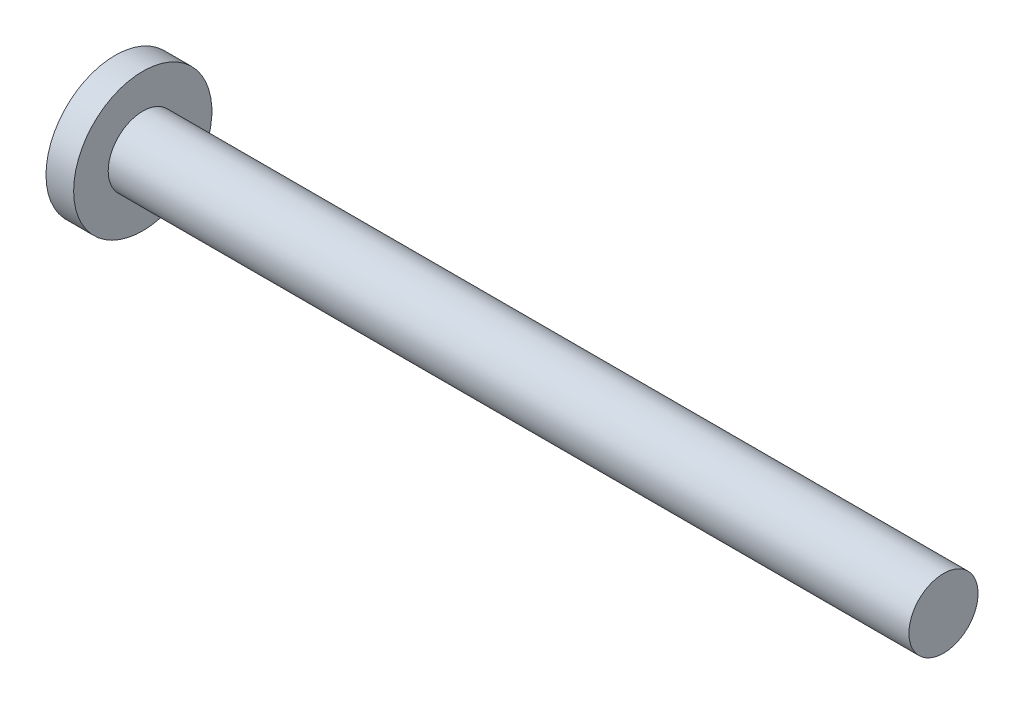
ISO-10303-21;
HEADER;
FILE_DESCRIPTION(('STEP AP214'),'2;1');
FILE_NAME('part.step','',(''),(''),'','','');
FILE_SCHEMA(('AUTOMOTIVE_DESIGN { 1 0 10303 214 1 1 1 1 }'));
ENDSEC;
DATA;
#1=APPLICATION_CONTEXT('core data for automotive mechanical design processes');
#2=APPLICATION_PROTOCOL_DEFINITION('international standard','automotive_design',2000,#1);
#3=PRODUCT_CONTEXT('',#1,'mechanical');
#4=PRODUCT('Part','Part','',(#3));
#5=PRODUCT_RELATED_PRODUCT_CATEGORY('part','',(#4));
#6=PRODUCT_DEFINITION_FORMATION('','',#4);
#7=PRODUCT_DEFINITION_CONTEXT('part definition',#1,'design');
#8=PRODUCT_DEFINITION('design','',#6,#7);
#9=PRODUCT_DEFINITION_SHAPE('','',#8);
#10=(LENGTH_UNIT() NAMED_UNIT(*) SI_UNIT(.MILLI.,.METRE.));
#11=(NAMED_UNIT(*) PLANE_ANGLE_UNIT() SI_UNIT($,.RADIAN.));
#12=(NAMED_UNIT(*) SI_UNIT($,.STERADIAN.) SOLID_ANGLE_UNIT());
#13=UNCERTAINTY_MEASURE_WITH_UNIT(LENGTH_MEASURE(1.E-05),#10,'distance_accuracy_value','');
#14=(GEOMETRIC_REPRESENTATION_CONTEXT(3) GLOBAL_UNCERTAINTY_ASSIGNED_CONTEXT((#13)) GLOBAL_UNIT_ASSIGNED_CONTEXT((#10,
#11,#12)) REPRESENTATION_CONTEXT('',''));
#15=CARTESIAN_POINT('',(0.,0.,0.));
#16=DIRECTION('',(0.,0.,1.));
#17=DIRECTION('',(1.,0.,0.));
#18=AXIS2_PLACEMENT_3D('',#15,#16,#17);
#19=CARTESIAN_POINT('',(0.,0.,0.));
#20=DIRECTION('',(1.,0.,0.));
#21=DIRECTION('',(0.,0.,-1.));
#22=AXIS2_PLACEMENT_3D('',#19,#20,#21);
#23=PLANE('',#22);
#24=CARTESIAN_POINT('',(0.,0.,0.));
#25=DIRECTION('',(-1.,0.,0.));
#26=DIRECTION('',(0.,0.,1.));
#27=AXIS2_PLACEMENT_3D('',#24,#25,#26);
#28=CIRCLE('',#27,3.3909);
#29=CARTESIAN_POINT('',(0.,0.,3.3909));
#30=VERTEX_POINT('',#29);
#31=EDGE_CURVE('E10',#30,#30,#28,.T.);
#32=ORIENTED_EDGE('',*,*,#31,.T.);
#33=EDGE_LOOP('',(#32));
#34=FACE_BOUND('',#33,.T.);
#35=ADVANCED_FACE('F31',(#34),#23,.F.);
#36=CARTESIAN_POINT('',(40.64,0.,0.));
#37=DIRECTION('',(-1.,0.,0.));
#38=DIRECTION('',(0.,0.,1.));
#39=AXIS2_PLACEMENT_3D('',#36,#37,#38);
#40=CYLINDRICAL_SURFACE('',#39,3.3909);
#41=ORIENTED_EDGE('',*,*,#31,.F.);
#42=EDGE_LOOP('',(#41));
#43=FACE_BOUND('',#42,.T.);
#44=CARTESIAN_POINT('',(1.35636,0.,0.));
#45=DIRECTION('',(-1.,0.,0.));
#46=DIRECTION('',(0.,0.,1.));
#47=AXIS2_PLACEMENT_3D('',#44,#45,#46);
#48=CIRCLE('',#47,3.3909);
#49=CARTESIAN_POINT('',(1.35636,0.,3.3909));
#50=VERTEX_POINT('',#49);
#51=EDGE_CURVE('E37',#50,#50,#48,.T.);
#52=ORIENTED_EDGE('',*,*,#51,.T.);
#53=EDGE_LOOP('',(#52));
#54=FACE_BOUND('',#53,.T.);
#55=ADVANCED_FACE('F63',(#43,#54),#40,.T.);
#56=CARTESIAN_POINT('',(1.35636,3.3909,0.));
#57=DIRECTION('',(-1.,0.,0.));
#58=DIRECTION('',(0.,0.,1.));
#59=AXIS2_PLACEMENT_3D('',#56,#57,#58);
#60=PLANE('',#59);
#61=ORIENTED_EDGE('',*,*,#51,.F.);
#62=EDGE_LOOP('',(#61));
#63=FACE_BOUND('',#62,.T.);
#64=CARTESIAN_POINT('',(1.35636,0.,0.));
#65=DIRECTION('',(-1.,0.,0.));
#66=DIRECTION('',(0.,0.,1.));
#67=AXIS2_PLACEMENT_3D('',#64,#65,#66);
#68=CIRCLE('',#67,1.69545);
#69=CARTESIAN_POINT('',(1.35636,0.,1.69545));
#70=VERTEX_POINT('',#69);
#71=EDGE_CURVE('E41',#70,#70,#68,.T.);
#72=ORIENTED_EDGE('',*,*,#71,.T.);
#73=EDGE_LOOP('',(#72));
#74=FACE_BOUND('',#73,.T.);
#75=ADVANCED_FACE('F59',(#63,#74),#60,.F.);
#76=CARTESIAN_POINT('',(40.64,0.,0.));
#77=DIRECTION('',(-1.,0.,0.));
#78=DIRECTION('',(0.,0.,1.));
#79=AXIS2_PLACEMENT_3D('',#76,#77,#78);
#80=CYLINDRICAL_SURFACE('',#79,1.69545);
#81=ORIENTED_EDGE('',*,*,#71,.F.);
#82=EDGE_LOOP('',(#81));
#83=FACE_BOUND('',#82,.T.);
#84=CARTESIAN_POINT('',(40.64,0.,0.));
#85=DIRECTION('',(-1.,0.,0.));
#86=DIRECTION('',(0.,0.,1.));
#87=AXIS2_PLACEMENT_3D('',#84,#85,#86);
#88=CIRCLE('',#87,1.69545);
#89=CARTESIAN_POINT('',(40.64,0.,1.69545));
#90=VERTEX_POINT('',#89);
#91=EDGE_CURVE('E45',#90,#90,#88,.T.);
#92=ORIENTED_EDGE('',*,*,#91,.T.);
#93=EDGE_LOOP('',(#92));
#94=FACE_BOUND('',#93,.T.);
#95=ADVANCED_FACE('F51',(#83,#94),#80,.T.);
#96=CARTESIAN_POINT('',(40.64,1.69545,0.));
#97=DIRECTION('',(-1.,0.,0.));
#98=DIRECTION('',(0.,0.,1.));
#99=AXIS2_PLACEMENT_3D('',#96,#97,#98);
#100=PLANE('',#99);
#101=ORIENTED_EDGE('',*,*,#91,.F.);
#102=EDGE_LOOP('',(#101));
#103=FACE_BOUND('',#102,.T.);
#104=ADVANCED_FACE('F53',(#103),#100,.F.);
#105=CLOSED_SHELL('',(#35,#55,#75,#95,#104));
#106=MANIFOLD_SOLID_BREP('B2',#105);
#107=ADVANCED_BREP_SHAPE_REPRESENTATION('',(#18,#106),#14);
#108=SHAPE_DEFINITION_REPRESENTATION(#9,#107);
ENDSEC;
END-ISO-10303-21;
